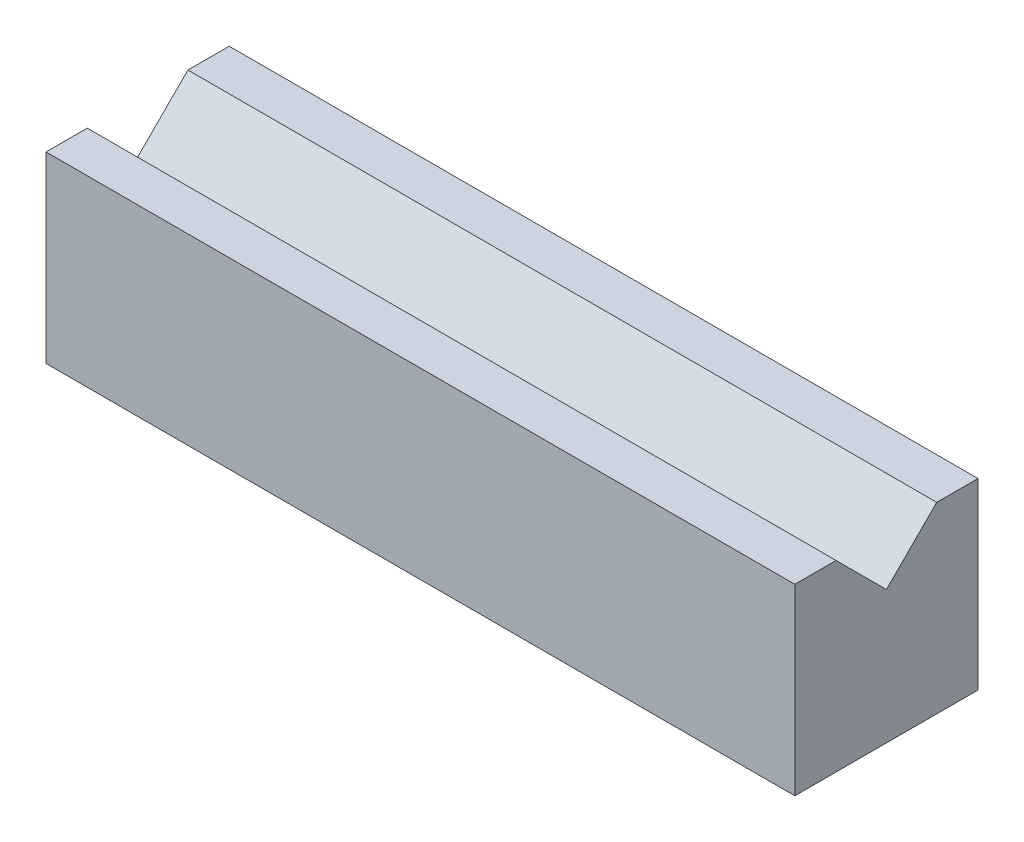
ISO-10303-21;
HEADER;
FILE_DESCRIPTION(('STEP AP214'),'2;1');
FILE_NAME('part.step','',(''),(''),'','','');
FILE_SCHEMA(('AUTOMOTIVE_DESIGN { 1 0 10303 214 1 1 1 1 }'));
ENDSEC;
DATA;
#1=APPLICATION_CONTEXT('core data for automotive mechanical design processes');
#2=APPLICATION_PROTOCOL_DEFINITION('international standard','automotive_design',2000,#1);
#3=PRODUCT_CONTEXT('',#1,'mechanical');
#4=PRODUCT('Part','Part','',(#3));
#5=PRODUCT_RELATED_PRODUCT_CATEGORY('part','',(#4));
#6=PRODUCT_DEFINITION_FORMATION('','',#4);
#7=PRODUCT_DEFINITION_CONTEXT('part definition',#1,'design');
#8=PRODUCT_DEFINITION('design','',#6,#7);
#9=PRODUCT_DEFINITION_SHAPE('','',#8);
#10=(LENGTH_UNIT() NAMED_UNIT(*) SI_UNIT(.MILLI.,.METRE.));
#11=(NAMED_UNIT(*) PLANE_ANGLE_UNIT() SI_UNIT($,.RADIAN.));
#12=(NAMED_UNIT(*) SI_UNIT($,.STERADIAN.) SOLID_ANGLE_UNIT());
#13=UNCERTAINTY_MEASURE_WITH_UNIT(LENGTH_MEASURE(1.E-05),#10,'distance_accuracy_value','');
#14=(GEOMETRIC_REPRESENTATION_CONTEXT(3) GLOBAL_UNCERTAINTY_ASSIGNED_CONTEXT((#13)) GLOBAL_UNIT_ASSIGNED_CONTEXT((#10,
#11,#12)) REPRESENTATION_CONTEXT('',''));
#15=CARTESIAN_POINT('',(0.,0.,0.));
#16=DIRECTION('',(0.,0.,1.));
#17=DIRECTION('',(1.,0.,0.));
#18=AXIS2_PLACEMENT_3D('',#15,#16,#17);
#19=CARTESIAN_POINT('',(0.,2.31139999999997,1.1557));
#20=DIRECTION('',(0.,-0.999999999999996,0.));
#21=DIRECTION('',(0.,0.,-0.999999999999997));
#22=AXIS2_PLACEMENT_3D('',#19,#20,#21);
#23=PLANE('',#22);
#24=DIRECTION('',(0.,0.,-0.999999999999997));
#25=VECTOR('',#24,1.);
#26=CARTESIAN_POINT('',(-4.7244,2.31139999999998,1.15570000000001));
#27=LINE('',#26,#25);
#28=CARTESIAN_POINT('',(-4.72439999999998,2.31139999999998,-0.63499999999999));
#29=VERTEX_POINT('',#28);
#30=CARTESIAN_POINT('',(-4.72439999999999,2.31139999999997,-1.15569999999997));
#31=VERTEX_POINT('',#30);
#32=EDGE_CURVE('E129',#29,#31,#27,.T.);
#33=ORIENTED_EDGE('',*,*,#32,.F.);
#34=DIRECTION('',(1.,0.,0.));
#35=VECTOR('',#34,1.);
#36=CARTESIAN_POINT('',(-4.72439999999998,2.31139999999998,-0.63499999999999));
#37=LINE('',#36,#35);
#38=CARTESIAN_POINT('',(4.72440000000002,2.31139999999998,-0.63499999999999));
#39=VERTEX_POINT('',#38);
#40=EDGE_CURVE('E135',#29,#39,#37,.T.);
#41=ORIENTED_EDGE('',*,*,#40,.T.);
#42=DIRECTION('',(0.,0.,-0.999999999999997));
#43=VECTOR('',#42,1.);
#44=CARTESIAN_POINT('',(4.72440000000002,2.31139999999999,1.15570000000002));
#45=LINE('',#44,#43);
#46=CARTESIAN_POINT('',(4.72440000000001,2.31139999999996,-1.15569999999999));
#47=VERTEX_POINT('',#46);
#48=EDGE_CURVE('E109',#39,#47,#45,.T.);
#49=ORIENTED_EDGE('',*,*,#48,.T.);
#50=DIRECTION('',(-1.,0.,0.));
#51=VECTOR('',#50,1.);
#52=CARTESIAN_POINT('',(0.,2.31139999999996,-1.15569999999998));
#53=LINE('',#52,#51);
#54=EDGE_CURVE('E115',#47,#31,#53,.T.);
#55=ORIENTED_EDGE('',*,*,#54,.T.);
#56=EDGE_LOOP('',(#33,#41,#49,#55));
#57=FACE_BOUND('',#56,.T.);
#58=ADVANCED_FACE('F30',(#57),#23,.F.);
#59=CARTESIAN_POINT('',(0.,0.,1.15570000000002));
#60=DIRECTION('',(0.,0.999999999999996,0.));
#61=DIRECTION('',(0.,0.,0.999999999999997));
#62=AXIS2_PLACEMENT_3D('',#59,#60,#61);
#63=PLANE('',#62);
#64=DIRECTION('',(1.,0.,0.));
#65=VECTOR('',#64,1.);
#66=CARTESIAN_POINT('',(0.,0.,1.15570000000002));
#67=LINE('',#66,#65);
#68=CARTESIAN_POINT('',(-4.72439999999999,0.,1.15570000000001));
#69=VERTEX_POINT('',#68);
#70=CARTESIAN_POINT('',(4.72440000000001,0.,1.15570000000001));
#71=VERTEX_POINT('',#70);
#72=EDGE_CURVE('E113',#69,#71,#67,.T.);
#73=ORIENTED_EDGE('',*,*,#72,.F.);
#74=DIRECTION('',(0.,0.,-0.999999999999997));
#75=VECTOR('',#74,1.);
#76=CARTESIAN_POINT('',(-4.72439999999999,0.,1.15570000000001));
#77=LINE('',#76,#75);
#78=CARTESIAN_POINT('',(-4.72439999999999,0.,-1.15569999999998));
#79=VERTEX_POINT('',#78);
#80=EDGE_CURVE('E124',#69,#79,#77,.T.);
#81=ORIENTED_EDGE('',*,*,#80,.T.);
#82=DIRECTION('',(1.,0.,0.));
#83=VECTOR('',#82,1.);
#84=CARTESIAN_POINT('',(0.,0.,-1.1557));
#85=LINE('',#84,#83);
#86=CARTESIAN_POINT('',(4.7244,0.,-1.15569999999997));
#87=VERTEX_POINT('',#86);
#88=EDGE_CURVE('E121',#79,#87,#85,.T.);
#89=ORIENTED_EDGE('',*,*,#88,.T.);
#90=DIRECTION('',(0.,0.,-0.999999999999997));
#91=VECTOR('',#90,1.);
#92=CARTESIAN_POINT('',(4.72440000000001,0.,1.15570000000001));
#93=LINE('',#92,#91);
#94=EDGE_CURVE('E11',#71,#87,#93,.T.);
#95=ORIENTED_EDGE('',*,*,#94,.F.);
#96=EDGE_LOOP('',(#73,#81,#89,#95));
#97=FACE_BOUND('',#96,.T.);
#98=ADVANCED_FACE('F32',(#97),#63,.F.);
#99=CARTESIAN_POINT('',(4.72440000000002,2.31139999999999,1.15570000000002));
#100=DIRECTION('',(-1.,0.,0.));
#101=DIRECTION('',(0.,0.,0.999999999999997));
#102=AXIS2_PLACEMENT_3D('',#99,#100,#101);
#103=PLANE('',#102);
#104=ORIENTED_EDGE('',*,*,#48,.F.);
#105=DIRECTION('',(0.,0.707106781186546,-0.707106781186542));
#106=VECTOR('',#105,1.);
#107=CARTESIAN_POINT('',(4.72440000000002,1.67639999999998,0.));
#108=LINE('',#107,#106);
#109=CARTESIAN_POINT('',(4.72440000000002,1.67639999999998,0.));
#110=VERTEX_POINT('',#109);
#111=EDGE_CURVE('E105',#110,#39,#108,.T.);
#112=ORIENTED_EDGE('',*,*,#111,.F.);
#113=DIRECTION('',(0.,-0.707106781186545,-0.707106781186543));
#114=VECTOR('',#113,1.);
#115=CARTESIAN_POINT('',(4.72440000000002,2.31139999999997,0.635000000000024));
#116=LINE('',#115,#114);
#117=CARTESIAN_POINT('',(4.72440000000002,2.31139999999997,0.635000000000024));
#118=VERTEX_POINT('',#117);
#119=EDGE_CURVE('E91',#118,#110,#116,.T.);
#120=ORIENTED_EDGE('',*,*,#119,.F.);
#121=CARTESIAN_POINT('',(4.72440000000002,2.31139999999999,1.15570000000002));
#122=VERTEX_POINT('',#121);
#123=EDGE_CURVE('E38',#122,#118,#45,.T.);
#124=ORIENTED_EDGE('',*,*,#123,.F.);
#125=DIRECTION('',(0.,0.999999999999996,0.));
#126=VECTOR('',#125,1.);
#127=CARTESIAN_POINT('',(4.72440000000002,2.31139999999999,1.15570000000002));
#128=LINE('',#127,#126);
#129=EDGE_CURVE('E53',#71,#122,#128,.T.);
#130=ORIENTED_EDGE('',*,*,#129,.F.);
#131=ORIENTED_EDGE('',*,*,#94,.T.);
#132=DIRECTION('',(0.,0.999999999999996,0.));
#133=VECTOR('',#132,1.);
#134=CARTESIAN_POINT('',(4.72440000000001,2.31139999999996,-1.15569999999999));
#135=LINE('',#134,#133);
#136=EDGE_CURVE('E118',#87,#47,#135,.T.);
#137=ORIENTED_EDGE('',*,*,#136,.T.);
#138=EDGE_LOOP('',(#104,#112,#120,#124,#130,#131,#137));
#139=FACE_BOUND('',#138,.T.);
#140=ADVANCED_FACE('F103',(#139),#103,.F.);
#141=ORIENTED_EDGE('',*,*,#123,.T.);
#142=DIRECTION('',(1.,0.,0.));
#143=VECTOR('',#142,1.);
#144=CARTESIAN_POINT('',(-4.72439999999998,2.31139999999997,0.635000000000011));
#145=LINE('',#144,#143);
#146=CARTESIAN_POINT('',(-4.72439999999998,2.31139999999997,0.635000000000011));
#147=VERTEX_POINT('',#146);
#148=EDGE_CURVE('E88',#147,#118,#145,.T.);
#149=ORIENTED_EDGE('',*,*,#148,.F.);
#150=CARTESIAN_POINT('',(-4.7244,2.31139999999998,1.15570000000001));
#151=VERTEX_POINT('',#150);
#152=EDGE_CURVE('E127',#151,#147,#27,.T.);
#153=ORIENTED_EDGE('',*,*,#152,.F.);
#154=DIRECTION('',(-1.,0.,0.));
#155=VECTOR('',#154,1.);
#156=CARTESIAN_POINT('',(0.,2.31139999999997,1.1557));
#157=LINE('',#156,#155);
#158=EDGE_CURVE('E108',#122,#151,#157,.T.);
#159=ORIENTED_EDGE('',*,*,#158,.F.);
#160=EDGE_LOOP('',(#141,#149,#153,#159));
#161=FACE_BOUND('',#160,.T.);
#162=ADVANCED_FACE('F107',(#161),#23,.F.);
#163=CARTESIAN_POINT('',(0.,0.,1.15570000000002));
#164=DIRECTION('',(0.,0.,0.999999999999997));
#165=DIRECTION('',(1.,0.,0.));
#166=AXIS2_PLACEMENT_3D('',#163,#164,#165);
#167=PLANE('',#166);
#168=ORIENTED_EDGE('',*,*,#158,.T.);
#169=DIRECTION('',(0.,0.999999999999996,0.));
#170=VECTOR('',#169,1.);
#171=CARTESIAN_POINT('',(-4.7244,2.31139999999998,1.15570000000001));
#172=LINE('',#171,#170);
#173=EDGE_CURVE('E130',#69,#151,#172,.T.);
#174=ORIENTED_EDGE('',*,*,#173,.F.);
#175=ORIENTED_EDGE('',*,*,#72,.T.);
#176=ORIENTED_EDGE('',*,*,#129,.T.);
#177=EDGE_LOOP('',(#168,#174,#175,#176));
#178=FACE_BOUND('',#177,.T.);
#179=ADVANCED_FACE('F156',(#178),#167,.T.);
#180=CARTESIAN_POINT('',(0.,0.,-1.1557));
#181=DIRECTION('',(0.,0.,0.999999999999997));
#182=DIRECTION('',(1.,0.,0.));
#183=AXIS2_PLACEMENT_3D('',#180,#181,#182);
#184=PLANE('',#183);
#185=ORIENTED_EDGE('',*,*,#88,.F.);
#186=DIRECTION('',(0.,0.999999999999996,0.));
#187=VECTOR('',#186,1.);
#188=CARTESIAN_POINT('',(-4.72439999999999,2.31139999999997,-1.15569999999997));
#189=LINE('',#188,#187);
#190=EDGE_CURVE('E133',#79,#31,#189,.T.);
#191=ORIENTED_EDGE('',*,*,#190,.T.);
#192=ORIENTED_EDGE('',*,*,#54,.F.);
#193=ORIENTED_EDGE('',*,*,#136,.F.);
#194=EDGE_LOOP('',(#185,#191,#192,#193));
#195=FACE_BOUND('',#194,.T.);
#196=ADVANCED_FACE('F149',(#195),#184,.F.);
#197=CARTESIAN_POINT('',(-4.7244,2.31139999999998,1.15570000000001));
#198=DIRECTION('',(1.,0.,0.));
#199=DIRECTION('',(0.,0.,0.999999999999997));
#200=AXIS2_PLACEMENT_3D('',#197,#198,#199);
#201=PLANE('',#200);
#202=DIRECTION('',(0.,-0.707106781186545,-0.707106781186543));
#203=VECTOR('',#202,1.);
#204=CARTESIAN_POINT('',(-4.72439999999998,2.31139999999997,0.635000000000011));
#205=LINE('',#204,#203);
#206=CARTESIAN_POINT('',(-4.72439999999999,1.6764,0.));
#207=VERTEX_POINT('',#206);
#208=EDGE_CURVE('E94',#147,#207,#205,.T.);
#209=ORIENTED_EDGE('',*,*,#208,.T.);
#210=DIRECTION('',(0.,0.707106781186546,-0.707106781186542));
#211=VECTOR('',#210,1.);
#212=CARTESIAN_POINT('',(-4.72439999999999,1.6764,0.));
#213=LINE('',#212,#211);
#214=EDGE_CURVE('E45',#207,#29,#213,.T.);
#215=ORIENTED_EDGE('',*,*,#214,.T.);
#216=ORIENTED_EDGE('',*,*,#32,.T.);
#217=ORIENTED_EDGE('',*,*,#190,.F.);
#218=ORIENTED_EDGE('',*,*,#80,.F.);
#219=ORIENTED_EDGE('',*,*,#173,.T.);
#220=ORIENTED_EDGE('',*,*,#152,.T.);
#221=EDGE_LOOP('',(#209,#215,#216,#217,#218,#219,#220));
#222=FACE_BOUND('',#221,.T.);
#223=ADVANCED_FACE('F153',(#222),#201,.F.);
#224=CARTESIAN_POINT('',(-4.72439999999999,1.6764,0.));
#225=DIRECTION('',(0.,-0.70710678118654,-0.707106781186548));
#226=DIRECTION('',(0.,0.707106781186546,-0.707106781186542));
#227=AXIS2_PLACEMENT_3D('',#224,#225,#226);
#228=PLANE('',#227);
#229=ORIENTED_EDGE('',*,*,#40,.F.);
#230=ORIENTED_EDGE('',*,*,#214,.F.);
#231=DIRECTION('',(1.,0.,0.));
#232=VECTOR('',#231,1.);
#233=CARTESIAN_POINT('',(-4.72439999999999,1.6764,0.));
#234=LINE('',#233,#232);
#235=EDGE_CURVE('E99',#207,#110,#234,.T.);
#236=ORIENTED_EDGE('',*,*,#235,.T.);
#237=ORIENTED_EDGE('',*,*,#111,.T.);
#238=EDGE_LOOP('',(#229,#230,#236,#237));
#239=FACE_BOUND('',#238,.T.);
#240=ADVANCED_FACE('F142',(#239),#228,.F.);
#241=CARTESIAN_POINT('',(-4.72439999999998,2.31139999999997,0.635000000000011));
#242=DIRECTION('',(0.,-0.707106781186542,0.707106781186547));
#243=DIRECTION('',(0.,-0.707106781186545,-0.707106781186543));
#244=AXIS2_PLACEMENT_3D('',#241,#242,#243);
#245=PLANE('',#244);
#246=ORIENTED_EDGE('',*,*,#235,.F.);
#247=ORIENTED_EDGE('',*,*,#208,.F.);
#248=ORIENTED_EDGE('',*,*,#148,.T.);
#249=ORIENTED_EDGE('',*,*,#119,.T.);
#250=EDGE_LOOP('',(#246,#247,#248,#249));
#251=FACE_BOUND('',#250,.T.);
#252=ADVANCED_FACE('F90',(#251),#245,.F.);
#253=CLOSED_SHELL('',(#58,#98,#140,#162,#179,#196,#223,#240,#252));
#254=MANIFOLD_SOLID_BREP('B2',#253);
#255=ADVANCED_BREP_SHAPE_REPRESENTATION('',(#18,#254),#14);
#256=SHAPE_DEFINITION_REPRESENTATION(#9,#255);
ENDSEC;
END-ISO-10303-21;
